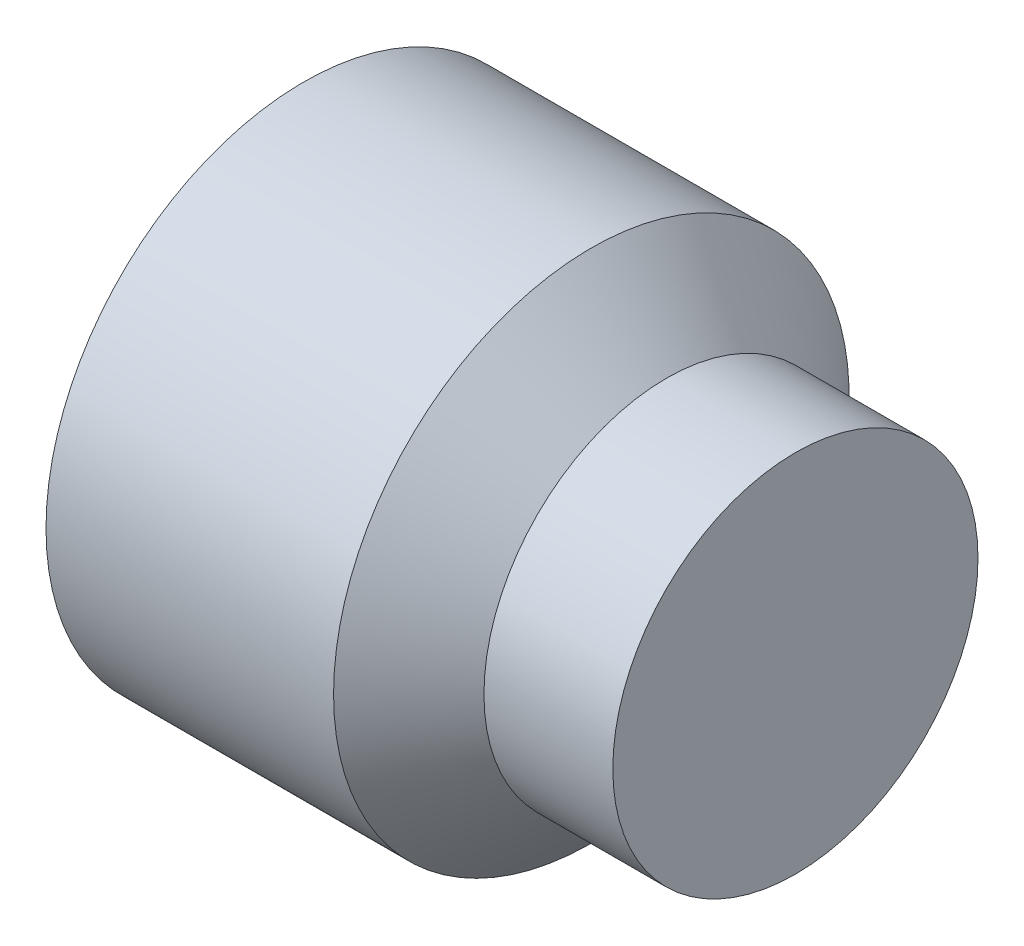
from build123d import *

# Parameters (mm, degrees)
COUNTERSINK_DEPTH = 4.8


with BuildPart() as part:
    # BodySke → BaseBody (revolve)
    with BuildSketch(Plane.XY, mode=Mode.PRIVATE) as basebody_sk:
        Polygon((0, 0), (0, 5.036), (0.556565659, 6), (7.25, 6), (9, 4.25), (12, 4.25), (12, 0), align=None)
    revolve(basebody_sk.sketch.rotate(Axis((0, 0, 0), (1, 0, 0)), 90), axis=Axis((0, 0, 0), (1, 0, 0)))

    # CountersinkSke → Countersink (cut)
    with BuildSketch(Plane(origin=(0, 0, 0), x_dir=(0, 0, -1), z_dir=(1, 0, 0))):
        Polygon((0, 3.464101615), (-3, 1.732050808), (-3, -1.732050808), (0, -3.464101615), (3, -1.732050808), (3, 1.732050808), align=None)
    extrude(amount=COUNTERSINK_DEPTH, mode=Mode.SUBTRACT)


solid = part.part
